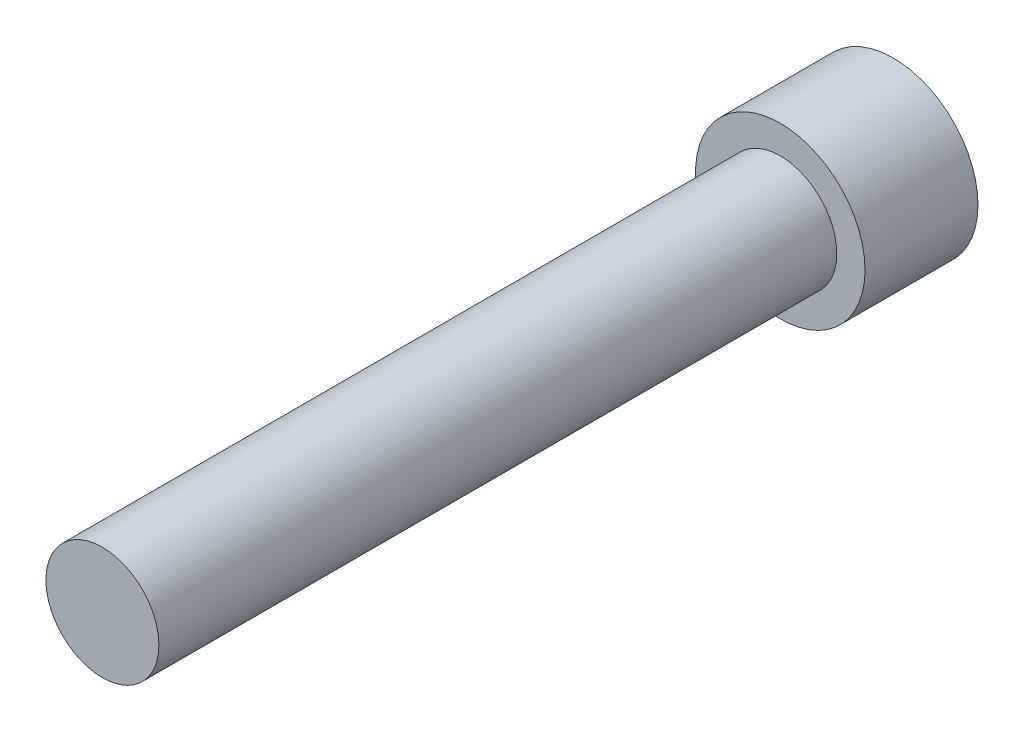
from build123d import *

# Parameters (mm, degrees)
HEX_2_DEPTH = 3.556


with BuildPart() as part:
    # Sketch6 → Revolve1 (revolve)
    with BuildSketch(Plane(origin=(0, 0, 0), x_dir=(0, 0, -1), z_dir=(1, 0, 0)), mode=Mode.PRIVATE) as revolve1_sk:
        Polygon((-38.1, 0), (-38.1, -3.175), (0, -3.175), (0, -4.7625), (6.35, -4.7625), (6.35, 0), align=None)
    revolve(revolve1_sk.sketch.rotate(Axis((0, 0, 38.1), (0, 0, -1)), 270), axis=Axis((0, 0, 38.1), (0, 0, -1)))

    # Sketch7 → HEX 2 (cut)
    with BuildSketch(Plane(origin=(0, 0, -6.35), x_dir=(-1, 0, 0), z_dir=(0, 0, -1))):
        Polygon((-2.3876, 1.378481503), (-2.3876, -1.378481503), (0, -2.756963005), (2.3876, -1.378481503), (2.3876, 1.378481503), (0, 2.756963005), align=None)
    extrude(amount=-HEX_2_DEPTH, mode=Mode.SUBTRACT)


solid = part.part
